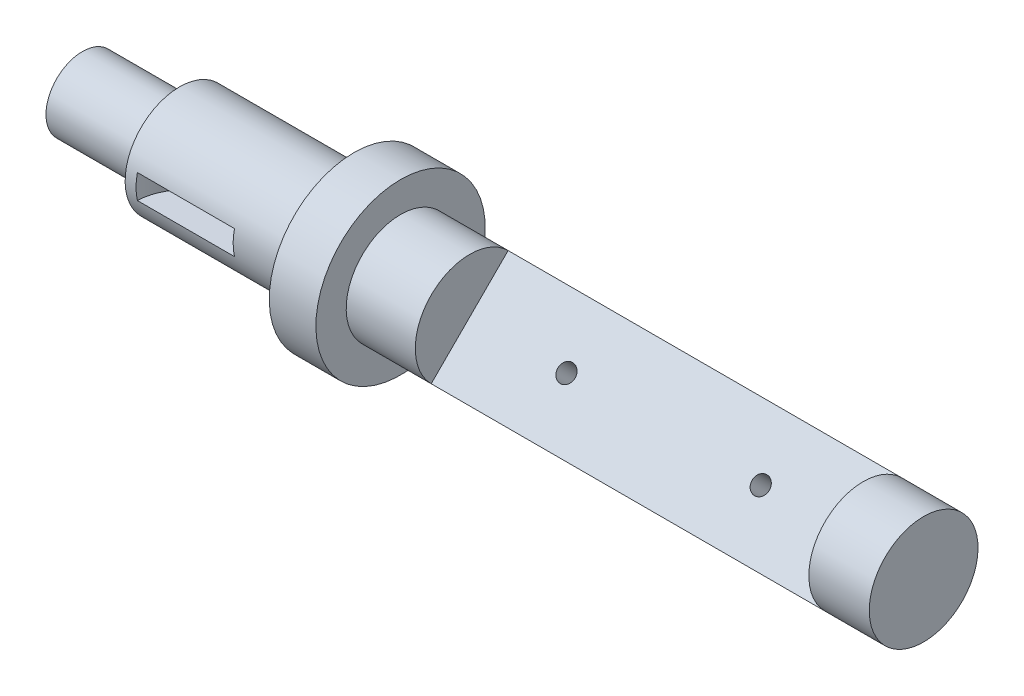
from build123d import *

# Parameters (mm, degrees)
CUT_EXTRUDE1_REACH        = 105.195
SKETCH2_W                 = 51.462
SKETCH2_H                 = 14.224
F_4_40_TAPPED_HOLE1_D     = 2.2606
F_4_40_TAPPED_HOLE1_DEPTH = 7.5946
F_4_40_TAPPED_HOLE1_TIP   = 0.679152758
CUT_EXTRUDE2_DEPTH        = 1.5875


with BuildPart() as part:
    # Sketch1 → Revolve1 (revolve)
    with BuildSketch(Plane.XY):
        Polygon((-8, 0), (-8, 4.7625), (4.7, 4.7625), (4.7, 7.112), (27.5092, 7.112), (27.5092, 11.0744), (33.6052, 11.0744), (33.6052, 7.112), (102, 7.112), (102, 0), align=None)
    revolve(axis=Axis((102, 0, 0), (-1, 0, 0)))

    # Sketch2 → Cut-Extrude1 (cut, up to next)
    with BuildSketch(Plane(origin=(0, 0, 0), x_dir=(-1, 0, 0), z_dir=(0, 0.7071067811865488, 0.7071067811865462)), mode=Mode.PRIVATE) as cut_extrude1_sk1:
        with Locations((-68.3696, 0)):
            Rectangle(SKETCH2_W, SKETCH2_H)
    cut_extrude1_tool1 = extrude(cut_extrude1_sk1.sketch, amount=CUT_EXTRUDE1_REACH, mode=Mode.PRIVATE) & part.part
    add(cut_extrude1_tool1.solids().sort_by_distance((68.3696, 0, 0))[0], mode=Mode.SUBTRACT)

    # 4-40 Tapped Hole1
    with Locations(Plane(origin=(0, 0, 0), x_dir=(-1, 0, 0), z_dir=(0, 0.7071067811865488, 0.7071067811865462))):
        with Locations((-80.696799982, 0), (-55.296799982, 0)):
            Hole(F_4_40_TAPPED_HOLE1_D / 2, depth=F_4_40_TAPPED_HOLE1_DEPTH)
            with Locations((0, 0, -(F_4_40_TAPPED_HOLE1_DEPTH + F_4_40_TAPPED_HOLE1_TIP / 2))):  # 118° drill point
                Cone(0, F_4_40_TAPPED_HOLE1_D / 2, F_4_40_TAPPED_HOLE1_TIP, mode=Mode.SUBTRACT)

    # Sketch7 → Cut-Extrude2 (cut, symmetric)
    with BuildSketch(Plane(origin=(0, 0, 0), x_dir=(-1, 0, 0), z_dir=(0, 1, 0))):
        with BuildLine():
            Line((-18.8224, 7.112), (-6.1224, 7.112))
            ThreePointArc((-6.1224, 7.112), (-12.4724, 0.762), (-18.8224, 7.112))
        make_face()
    extrude(amount=CUT_EXTRUDE2_DEPTH, both=True, mode=Mode.SUBTRACT)


solid = part.part
